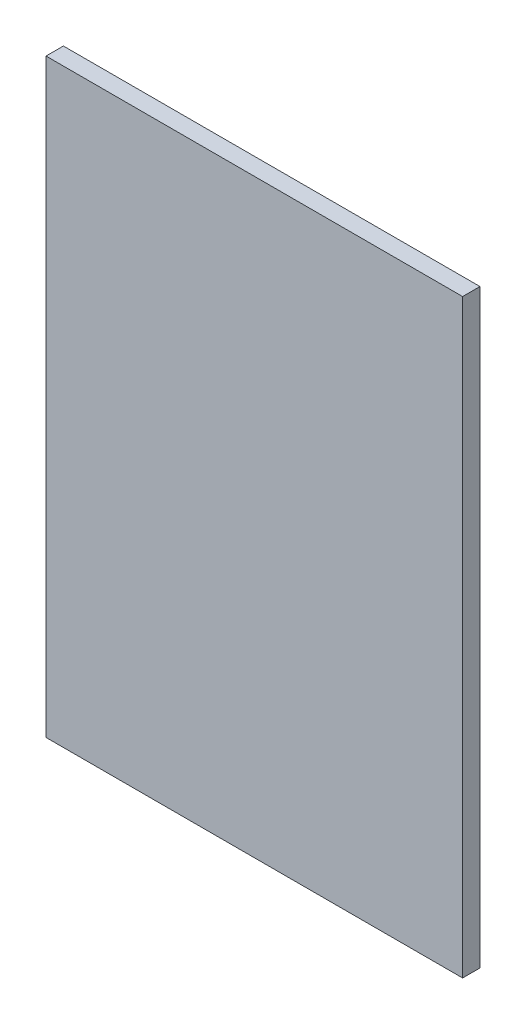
ISO-10303-21;
HEADER;
FILE_DESCRIPTION(('STEP AP214'),'2;1');
FILE_NAME('part.step','',(''),(''),'','','');
FILE_SCHEMA(('AUTOMOTIVE_DESIGN { 1 0 10303 214 1 1 1 1 }'));
ENDSEC;
DATA;
#1=APPLICATION_CONTEXT('core data for automotive mechanical design processes');
#2=APPLICATION_PROTOCOL_DEFINITION('international standard','automotive_design',2000,#1);
#3=PRODUCT_CONTEXT('',#1,'mechanical');
#4=PRODUCT('Part','Part','',(#3));
#5=PRODUCT_RELATED_PRODUCT_CATEGORY('part','',(#4));
#6=PRODUCT_DEFINITION_FORMATION('','',#4);
#7=PRODUCT_DEFINITION_CONTEXT('part definition',#1,'design');
#8=PRODUCT_DEFINITION('design','',#6,#7);
#9=PRODUCT_DEFINITION_SHAPE('','',#8);
#10=(LENGTH_UNIT() NAMED_UNIT(*) SI_UNIT(.MILLI.,.METRE.));
#11=(NAMED_UNIT(*) PLANE_ANGLE_UNIT() SI_UNIT($,.RADIAN.));
#12=(NAMED_UNIT(*) SI_UNIT($,.STERADIAN.) SOLID_ANGLE_UNIT());
#13=UNCERTAINTY_MEASURE_WITH_UNIT(LENGTH_MEASURE(1.E-05),#10,'distance_accuracy_value','');
#14=(GEOMETRIC_REPRESENTATION_CONTEXT(3) GLOBAL_UNCERTAINTY_ASSIGNED_CONTEXT((#13)) GLOBAL_UNIT_ASSIGNED_CONTEXT((#10,
#11,#12)) REPRESENTATION_CONTEXT('',''));
#15=CARTESIAN_POINT('',(0.,0.,0.));
#16=DIRECTION('',(0.,0.,1.));
#17=DIRECTION('',(1.,0.,0.));
#18=AXIS2_PLACEMENT_3D('',#15,#16,#17);
#19=CARTESIAN_POINT('',(-108.574532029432,108.832468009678,10.));
#20=DIRECTION('',(1.,0.,0.));
#21=DIRECTION('',(0.,1.,0.));
#22=AXIS2_PLACEMENT_3D('',#19,#20,#21);
#23=PLANE('',#22);
#24=DIRECTION('',(0.,-1.,0.));
#25=VECTOR('',#24,1.);
#26=CARTESIAN_POINT('',(-108.574532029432,108.832468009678,0.));
#27=LINE('',#26,#25);
#28=CARTESIAN_POINT('',(-108.574532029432,108.832468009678,0.));
#29=VERTEX_POINT('',#28);
#30=CARTESIAN_POINT('',(-108.574532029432,-231.167531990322,0.));
#31=VERTEX_POINT('',#30);
#32=EDGE_CURVE('E66',#29,#31,#27,.T.);
#33=ORIENTED_EDGE('',*,*,#32,.T.);
#34=DIRECTION('',(0.,0.,-1.));
#35=VECTOR('',#34,1.);
#36=CARTESIAN_POINT('',(-108.574532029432,-231.167531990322,10.));
#37=LINE('',#36,#35);
#38=CARTESIAN_POINT('',(-108.574532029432,-231.167531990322,10.));
#39=VERTEX_POINT('',#38);
#40=EDGE_CURVE('E11',#39,#31,#37,.T.);
#41=ORIENTED_EDGE('',*,*,#40,.F.);
#42=DIRECTION('',(0.,-1.,0.));
#43=VECTOR('',#42,1.);
#44=CARTESIAN_POINT('',(-108.574532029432,108.832468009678,10.));
#45=LINE('',#44,#43);
#46=CARTESIAN_POINT('',(-108.574532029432,108.832468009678,10.));
#47=VERTEX_POINT('',#46);
#48=EDGE_CURVE('E84',#47,#39,#45,.T.);
#49=ORIENTED_EDGE('',*,*,#48,.F.);
#50=DIRECTION('',(0.,0.,-1.));
#51=VECTOR('',#50,1.);
#52=CARTESIAN_POINT('',(-108.574532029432,108.832468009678,10.));
#53=LINE('',#52,#51);
#54=EDGE_CURVE('E78',#47,#29,#53,.T.);
#55=ORIENTED_EDGE('',*,*,#54,.T.);
#56=EDGE_LOOP('',(#33,#41,#49,#55));
#57=FACE_BOUND('',#56,.T.);
#58=ADVANCED_FACE('F22',(#57),#23,.F.);
#59=CARTESIAN_POINT('',(-108.574532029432,-231.167531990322,10.));
#60=DIRECTION('',(0.,1.,0.));
#61=DIRECTION('',(0.,0.,1.));
#62=AXIS2_PLACEMENT_3D('',#59,#60,#61);
#63=PLANE('',#62);
#64=DIRECTION('',(1.,0.,0.));
#65=VECTOR('',#64,1.);
#66=CARTESIAN_POINT('',(-108.574532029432,-231.167531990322,0.));
#67=LINE('',#66,#65);
#68=CARTESIAN_POINT('',(131.425467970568,-231.167531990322,0.));
#69=VERTEX_POINT('',#68);
#70=EDGE_CURVE('E62',#31,#69,#67,.T.);
#71=ORIENTED_EDGE('',*,*,#70,.T.);
#72=DIRECTION('',(0.,0.,-1.));
#73=VECTOR('',#72,1.);
#74=CARTESIAN_POINT('',(131.425467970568,-231.167531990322,10.));
#75=LINE('',#74,#73);
#76=CARTESIAN_POINT('',(131.425467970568,-231.167531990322,10.));
#77=VERTEX_POINT('',#76);
#78=EDGE_CURVE('E29',#77,#69,#75,.T.);
#79=ORIENTED_EDGE('',*,*,#78,.F.);
#80=DIRECTION('',(1.,0.,0.));
#81=VECTOR('',#80,1.);
#82=CARTESIAN_POINT('',(-108.574532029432,-231.167531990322,10.));
#83=LINE('',#82,#81);
#84=EDGE_CURVE('E74',#39,#77,#83,.T.);
#85=ORIENTED_EDGE('',*,*,#84,.F.);
#86=ORIENTED_EDGE('',*,*,#40,.T.);
#87=EDGE_LOOP('',(#71,#79,#85,#86));
#88=FACE_BOUND('',#87,.T.);
#89=ADVANCED_FACE('F73',(#88),#63,.F.);
#90=CARTESIAN_POINT('',(131.425467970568,108.832468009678,10.));
#91=DIRECTION('',(-1.,0.,0.));
#92=DIRECTION('',(0.,-1.,0.));
#93=AXIS2_PLACEMENT_3D('',#90,#91,#92);
#94=PLANE('',#93);
#95=DIRECTION('',(0.,1.,0.));
#96=VECTOR('',#95,1.);
#97=CARTESIAN_POINT('',(131.425467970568,108.832468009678,0.));
#98=LINE('',#97,#96);
#99=CARTESIAN_POINT('',(131.425467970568,108.832468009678,0.));
#100=VERTEX_POINT('',#99);
#101=EDGE_CURVE('E67',#69,#100,#98,.T.);
#102=ORIENTED_EDGE('',*,*,#101,.T.);
#103=DIRECTION('',(0.,0.,-1.));
#104=VECTOR('',#103,1.);
#105=CARTESIAN_POINT('',(131.425467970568,108.832468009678,10.));
#106=LINE('',#105,#104);
#107=CARTESIAN_POINT('',(131.425467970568,108.832468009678,10.));
#108=VERTEX_POINT('',#107);
#109=EDGE_CURVE('E90',#108,#100,#106,.T.);
#110=ORIENTED_EDGE('',*,*,#109,.F.);
#111=DIRECTION('',(0.,1.,0.));
#112=VECTOR('',#111,1.);
#113=CARTESIAN_POINT('',(131.425467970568,108.832468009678,10.));
#114=LINE('',#113,#112);
#115=EDGE_CURVE('E41',#77,#108,#114,.T.);
#116=ORIENTED_EDGE('',*,*,#115,.F.);
#117=ORIENTED_EDGE('',*,*,#78,.T.);
#118=EDGE_LOOP('',(#102,#110,#116,#117));
#119=FACE_BOUND('',#118,.T.);
#120=ADVANCED_FACE('F93',(#119),#94,.F.);
#121=CARTESIAN_POINT('',(-108.574532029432,108.832468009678,10.));
#122=DIRECTION('',(0.,-1.,0.));
#123=DIRECTION('',(0.,0.,-1.));
#124=AXIS2_PLACEMENT_3D('',#121,#122,#123);
#125=PLANE('',#124);
#126=DIRECTION('',(-1.,0.,0.));
#127=VECTOR('',#126,1.);
#128=CARTESIAN_POINT('',(-108.574532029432,108.832468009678,0.));
#129=LINE('',#128,#127);
#130=EDGE_CURVE('E82',#100,#29,#129,.T.);
#131=ORIENTED_EDGE('',*,*,#130,.T.);
#132=ORIENTED_EDGE('',*,*,#54,.F.);
#133=DIRECTION('',(-1.,0.,0.));
#134=VECTOR('',#133,1.);
#135=CARTESIAN_POINT('',(-108.574532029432,108.832468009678,10.));
#136=LINE('',#135,#134);
#137=EDGE_CURVE('E36',#108,#47,#136,.T.);
#138=ORIENTED_EDGE('',*,*,#137,.F.);
#139=ORIENTED_EDGE('',*,*,#109,.T.);
#140=EDGE_LOOP('',(#131,#132,#138,#139));
#141=FACE_BOUND('',#140,.T.);
#142=ADVANCED_FACE('F95',(#141),#125,.F.);
#143=CARTESIAN_POINT('',(-108.574532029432,108.832468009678,10.));
#144=DIRECTION('',(0.,0.,1.));
#145=DIRECTION('',(1.,0.,0.));
#146=AXIS2_PLACEMENT_3D('',#143,#144,#145);
#147=PLANE('',#146);
#148=ORIENTED_EDGE('',*,*,#48,.T.);
#149=ORIENTED_EDGE('',*,*,#84,.T.);
#150=ORIENTED_EDGE('',*,*,#115,.T.);
#151=ORIENTED_EDGE('',*,*,#137,.T.);
#152=EDGE_LOOP('',(#148,#149,#150,#151));
#153=FACE_BOUND('',#152,.T.);
#154=ADVANCED_FACE('F96',(#153),#147,.T.);
#155=CARTESIAN_POINT('',(-108.574532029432,108.832468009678,0.));
#156=DIRECTION('',(0.,0.,1.));
#157=DIRECTION('',(1.,0.,0.));
#158=AXIS2_PLACEMENT_3D('',#155,#156,#157);
#159=PLANE('',#158);
#160=ORIENTED_EDGE('',*,*,#32,.F.);
#161=ORIENTED_EDGE('',*,*,#130,.F.);
#162=ORIENTED_EDGE('',*,*,#101,.F.);
#163=ORIENTED_EDGE('',*,*,#70,.F.);
#164=EDGE_LOOP('',(#160,#161,#162,#163));
#165=FACE_BOUND('',#164,.T.);
#166=ADVANCED_FACE('F63',(#165),#159,.F.);
#167=CLOSED_SHELL('',(#58,#89,#120,#142,#154,#166));
#168=MANIFOLD_SOLID_BREP('B2',#167);
#169=ADVANCED_BREP_SHAPE_REPRESENTATION('',(#18,#168),#14);
#170=SHAPE_DEFINITION_REPRESENTATION(#9,#169);
ENDSEC;
END-ISO-10303-21;
